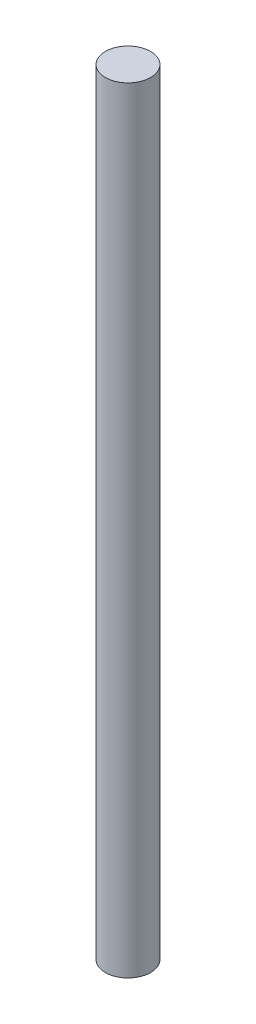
ISO-10303-21;
HEADER;
FILE_DESCRIPTION(('STEP AP214'),'2;1');
FILE_NAME('part.step','',(''),(''),'','','');
FILE_SCHEMA(('AUTOMOTIVE_DESIGN { 1 0 10303 214 1 1 1 1 }'));
ENDSEC;
DATA;
#1=APPLICATION_CONTEXT('core data for automotive mechanical design processes');
#2=APPLICATION_PROTOCOL_DEFINITION('international standard','automotive_design',2000,#1);
#3=PRODUCT_CONTEXT('',#1,'mechanical');
#4=PRODUCT('Part','Part','',(#3));
#5=PRODUCT_RELATED_PRODUCT_CATEGORY('part','',(#4));
#6=PRODUCT_DEFINITION_FORMATION('','',#4);
#7=PRODUCT_DEFINITION_CONTEXT('part definition',#1,'design');
#8=PRODUCT_DEFINITION('design','',#6,#7);
#9=PRODUCT_DEFINITION_SHAPE('','',#8);
#10=(LENGTH_UNIT() NAMED_UNIT(*) SI_UNIT(.MILLI.,.METRE.));
#11=(NAMED_UNIT(*) PLANE_ANGLE_UNIT() SI_UNIT($,.RADIAN.));
#12=(NAMED_UNIT(*) SI_UNIT($,.STERADIAN.) SOLID_ANGLE_UNIT());
#13=UNCERTAINTY_MEASURE_WITH_UNIT(LENGTH_MEASURE(1.E-05),#10,'distance_accuracy_value','');
#14=(GEOMETRIC_REPRESENTATION_CONTEXT(3) GLOBAL_UNCERTAINTY_ASSIGNED_CONTEXT((#13)) GLOBAL_UNIT_ASSIGNED_CONTEXT((#10,
#11,#12)) REPRESENTATION_CONTEXT('',''));
#15=CARTESIAN_POINT('',(0.,0.,0.));
#16=DIRECTION('',(0.,0.,1.));
#17=DIRECTION('',(1.,0.,0.));
#18=AXIS2_PLACEMENT_3D('',#15,#16,#17);
#19=CARTESIAN_POINT('',(0.,120.,0.));
#20=DIRECTION('',(0.,-1.,0.));
#21=DIRECTION('',(0.,0.,-1.));
#22=AXIS2_PLACEMENT_3D('',#19,#20,#21);
#23=CYLINDRICAL_SURFACE('',#22,3.5);
#24=CARTESIAN_POINT('',(0.,120.,0.));
#25=DIRECTION('',(0.,1.,0.));
#26=DIRECTION('',(0.,0.,1.));
#27=AXIS2_PLACEMENT_3D('',#24,#25,#26);
#28=CIRCLE('',#27,3.5);
#29=CARTESIAN_POINT('',(0.,120.,3.5));
#30=VERTEX_POINT('',#29);
#31=EDGE_CURVE('E10',#30,#30,#28,.T.);
#32=ORIENTED_EDGE('',*,*,#31,.F.);
#33=EDGE_LOOP('',(#32));
#34=FACE_BOUND('',#33,.T.);
#35=CARTESIAN_POINT('',(0.,0.,0.));
#36=DIRECTION('',(0.,1.,0.));
#37=DIRECTION('',(0.,0.,1.));
#38=AXIS2_PLACEMENT_3D('',#35,#36,#37);
#39=CIRCLE('',#38,3.5);
#40=CARTESIAN_POINT('',(0.,0.,3.5));
#41=VERTEX_POINT('',#40);
#42=EDGE_CURVE('E30',#41,#41,#39,.T.);
#43=ORIENTED_EDGE('',*,*,#42,.T.);
#44=EDGE_LOOP('',(#43));
#45=FACE_BOUND('',#44,.T.);
#46=ADVANCED_FACE('F24',(#34,#45),#23,.T.);
#47=CARTESIAN_POINT('',(0.,120.,0.));
#48=DIRECTION('',(0.,1.,0.));
#49=DIRECTION('',(0.,0.,1.));
#50=AXIS2_PLACEMENT_3D('',#47,#48,#49);
#51=PLANE('',#50);
#52=ORIENTED_EDGE('',*,*,#31,.T.);
#53=EDGE_LOOP('',(#52));
#54=FACE_BOUND('',#53,.T.);
#55=ADVANCED_FACE('F39',(#54),#51,.T.);
#56=CARTESIAN_POINT('',(0.,0.,0.));
#57=DIRECTION('',(0.,1.,0.));
#58=DIRECTION('',(0.,0.,1.));
#59=AXIS2_PLACEMENT_3D('',#56,#57,#58);
#60=PLANE('',#59);
#61=ORIENTED_EDGE('',*,*,#42,.F.);
#62=EDGE_LOOP('',(#61));
#63=FACE_BOUND('',#62,.T.);
#64=ADVANCED_FACE('F37',(#63),#60,.F.);
#65=CLOSED_SHELL('',(#46,#55,#64));
#66=MANIFOLD_SOLID_BREP('B2',#65);
#67=ADVANCED_BREP_SHAPE_REPRESENTATION('',(#18,#66),#14);
#68=SHAPE_DEFINITION_REPRESENTATION(#9,#67);
ENDSEC;
END-ISO-10303-21;
